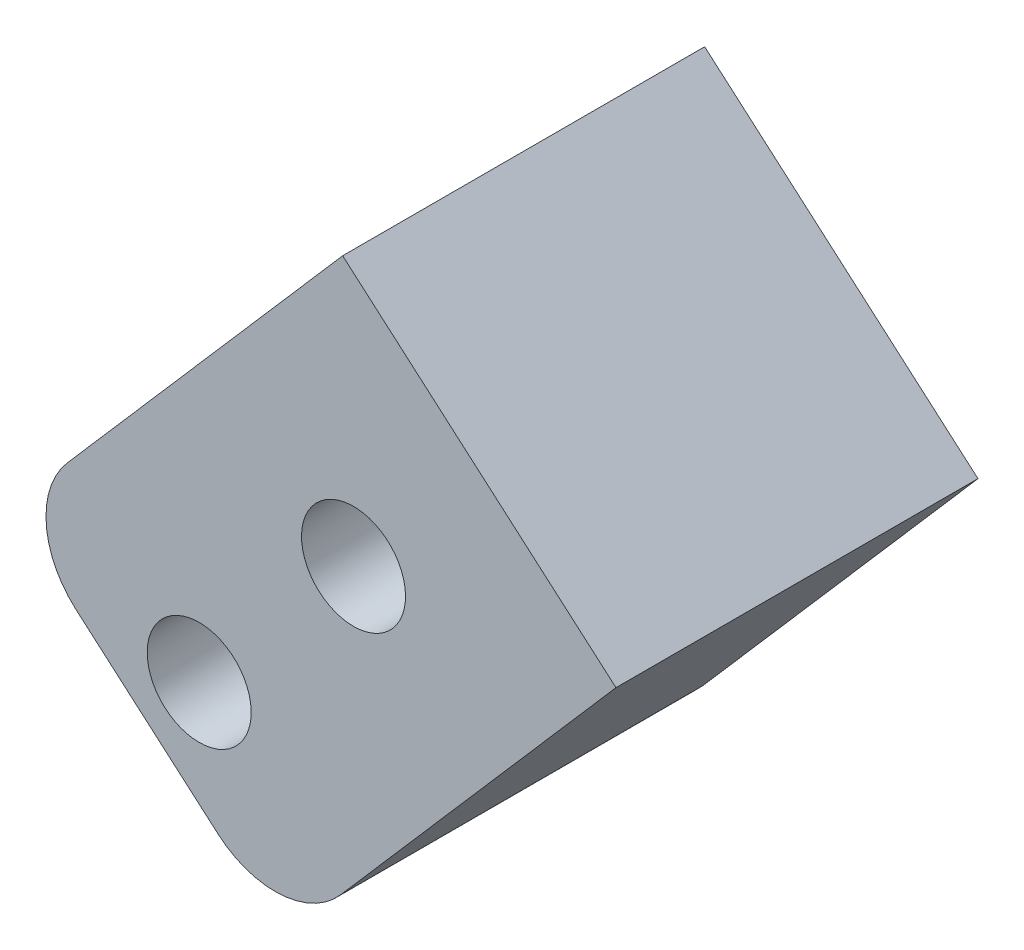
ISO-10303-21;
HEADER;
FILE_DESCRIPTION(('STEP AP214'),'2;1');
FILE_NAME('part.step','',(''),(''),'','','');
FILE_SCHEMA(('AUTOMOTIVE_DESIGN { 1 0 10303 214 1 1 1 1 }'));
ENDSEC;
DATA;
#1=APPLICATION_CONTEXT('core data for automotive mechanical design processes');
#2=APPLICATION_PROTOCOL_DEFINITION('international standard','automotive_design',2000,#1);
#3=PRODUCT_CONTEXT('',#1,'mechanical');
#4=PRODUCT('Part','Part','',(#3));
#5=PRODUCT_RELATED_PRODUCT_CATEGORY('part','',(#4));
#6=PRODUCT_DEFINITION_FORMATION('','',#4);
#7=PRODUCT_DEFINITION_CONTEXT('part definition',#1,'design');
#8=PRODUCT_DEFINITION('design','',#6,#7);
#9=PRODUCT_DEFINITION_SHAPE('','',#8);
#10=(LENGTH_UNIT() NAMED_UNIT(*) SI_UNIT(.MILLI.,.METRE.));
#11=(NAMED_UNIT(*) PLANE_ANGLE_UNIT() SI_UNIT($,.RADIAN.));
#12=(NAMED_UNIT(*) SI_UNIT($,.STERADIAN.) SOLID_ANGLE_UNIT());
#13=UNCERTAINTY_MEASURE_WITH_UNIT(LENGTH_MEASURE(1.E-05),#10,'distance_accuracy_value','');
#14=(GEOMETRIC_REPRESENTATION_CONTEXT(3) GLOBAL_UNCERTAINTY_ASSIGNED_CONTEXT((#13)) GLOBAL_UNIT_ASSIGNED_CONTEXT((#10,
#11,#12)) REPRESENTATION_CONTEXT('',''));
#15=CARTESIAN_POINT('',(0.,0.,0.));
#16=DIRECTION('',(0.,0.,1.));
#17=DIRECTION('',(1.,0.,0.));
#18=AXIS2_PLACEMENT_3D('',#15,#16,#17);
#19=CARTESIAN_POINT('',(0.,0.,-0.000643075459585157));
#20=DIRECTION('',(1.58417609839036E-11,-5.13786431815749E-12,-1.));
#21=DIRECTION('',(-1.,0.,-1.58417609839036E-11));
#22=AXIS2_PLACEMENT_3D('',#19,#20,#21);
#23=PLANE('',#22);
#24=CARTESIAN_POINT('',(-681.397191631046,-83.5701362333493,-0.000643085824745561));
#25=DIRECTION('',(0.,5.13786431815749E-12,1.));
#26=DIRECTION('',(0.,-1.,5.13786431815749E-12));
#27=AXIS2_PLACEMENT_3D('',#24,#25,#26);
#28=CIRCLE('',#27,4.55930000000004);
#29=CARTESIAN_POINT('',(-681.397191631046,-88.1294362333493,-0.000643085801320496));
#30=VERTEX_POINT('',#29);
#31=EDGE_CURVE('E199',#30,#30,#28,.T.);
#32=ORIENTED_EDGE('',*,*,#31,.F.);
#33=EDGE_LOOP('',(#32));
#34=FACE_BOUND('',#33,.T.);
#35=CARTESIAN_POINT('',(-694.928996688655,-99.1520699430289,-0.000643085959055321));
#36=DIRECTION('',(0.,5.13786431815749E-12,1.));
#37=DIRECTION('',(0.,-1.,5.13786431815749E-12));
#38=AXIS2_PLACEMENT_3D('',#35,#36,#37);
#39=CIRCLE('',#38,4.55930000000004);
#40=CARTESIAN_POINT('',(-694.928996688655,-103.711369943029,-0.000643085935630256));
#41=VERTEX_POINT('',#40);
#42=EDGE_CURVE('E183',#41,#41,#39,.T.);
#43=ORIENTED_EDGE('',*,*,#42,.F.);
#44=EDGE_LOOP('',(#43));
#45=FACE_BOUND('',#44,.T.);
#46=CARTESIAN_POINT('',(-700.745406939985,-93.259903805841,-0.000643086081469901));
#47=DIRECTION('',(1.58417609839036E-11,-5.13786431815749E-12,-1.));
#48=DIRECTION('',(-1.,0.,-1.58417609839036E-11));
#49=AXIS2_PLACEMENT_3D('',#46,#47,#48);
#50=CIRCLE('',#49,7.62000000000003);
#51=CARTESIAN_POINT('',(-705.741765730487,-99.0132331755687,-0.000643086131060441));
#52=VERTEX_POINT('',#51);
#53=CARTESIAN_POINT('',(-706.498736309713,-88.2635450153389,-0.000643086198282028));
#54=VERTEX_POINT('',#53);
#55=EDGE_CURVE('E100',#52,#54,#50,.T.);
#56=ORIENTED_EDGE('',*,*,#55,.F.);
#57=DIRECTION('',(-0.755030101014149,0.655690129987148,-1.53298533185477E-11));
#58=VECTOR('',#57,1.);
#59=CARTESIAN_POINT('',(-705.741765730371,-99.0132331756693,-0.000643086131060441));
#60=LINE('',#59,#58);
#61=CARTESIAN_POINT('',(-693.276218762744,-109.838677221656,-0.000643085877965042));
#62=VERTEX_POINT('',#61);
#63=EDGE_CURVE('E107',#62,#52,#60,.T.);
#64=ORIENTED_EDGE('',*,*,#63,.F.);
#65=CARTESIAN_POINT('',(-688.279859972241,-104.085347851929,-0.000643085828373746));
#66=DIRECTION('',(1.58417609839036E-11,-5.13786431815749E-12,-1.));
#67=DIRECTION('',(-1.,0.,-1.58417609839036E-11));
#68=AXIS2_PLACEMENT_3D('',#65,#66,#67);
#69=CIRCLE('',#68,7.61999999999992);
#70=CARTESIAN_POINT('',(-682.526530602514,-109.081706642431,-0.000643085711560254));
#71=VERTEX_POINT('',#70);
#72=EDGE_CURVE('E173',#71,#62,#69,.T.);
#73=ORIENTED_EDGE('',*,*,#72,.F.);
#74=DIRECTION('',(-0.655690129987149,-0.755030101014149,-6.50804410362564E-12));
#75=VECTOR('',#74,1.);
#76=CARTESIAN_POINT('',(-658.377463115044,-81.2739480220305,-0.00064308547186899));
#77=LINE('',#76,#75);
#78=CARTESIAN_POINT('',(-658.377463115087,-81.2739480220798,-0.000643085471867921));
#79=VERTEX_POINT('',#78);
#80=EDGE_CURVE('E169',#79,#71,#77,.T.);
#81=ORIENTED_EDGE('',*,*,#80,.F.);
#82=DIRECTION('',(0.755030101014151,-0.655690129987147,1.53298533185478E-11));
#83=VECTOR('',#82,1.);
#84=CARTESIAN_POINT('',(-682.349668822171,-60.4557863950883,-0.000643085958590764));
#85=LINE('',#84,#83);
#86=CARTESIAN_POINT('',(-682.349668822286,-60.4557863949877,-0.000643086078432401));
#87=VERTEX_POINT('',#86);
#88=EDGE_CURVE('E64',#87,#79,#85,.T.);
#89=ORIENTED_EDGE('',*,*,#88,.F.);
#90=DIRECTION('',(0.655690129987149,0.755030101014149,6.50804410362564E-12));
#91=VECTOR('',#90,1.);
#92=CARTESIAN_POINT('',(-682.349668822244,-60.4557863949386,-0.000643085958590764));
#93=LINE('',#92,#91);
#94=EDGE_CURVE('E12',#54,#87,#93,.T.);
#95=ORIENTED_EDGE('',*,*,#94,.F.);
#96=EDGE_LOOP('',(#56,#64,#73,#81,#89,#95));
#97=FACE_BOUND('',#96,.T.);
#98=ADVANCED_FACE('F48',(#34,#45,#97),#23,.F.);
#99=CARTESIAN_POINT('',(-700.745406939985,-93.259903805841,10.0076));
#100=DIRECTION('',(0.,0.,-1.));
#101=DIRECTION('',(-1.,0.,0.));
#102=AXIS2_PLACEMENT_3D('',#99,#100,#101);
#103=CYLINDRICAL_SURFACE('',#102,7.62000000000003);
#104=DIRECTION('',(0.,0.,-1.));
#105=VECTOR('',#104,1.);
#106=CARTESIAN_POINT('',(-705.741765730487,-99.0132331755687,10.0076));
#107=LINE('',#106,#105);
#108=CARTESIAN_POINT('',(-705.741765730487,-99.0132331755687,-31.75));
#109=VERTEX_POINT('',#108);
#110=EDGE_CURVE('E57',#52,#109,#107,.T.);
#111=ORIENTED_EDGE('',*,*,#110,.F.);
#112=ORIENTED_EDGE('',*,*,#55,.T.);
#113=DIRECTION('',(0.,0.,-1.));
#114=VECTOR('',#113,1.);
#115=CARTESIAN_POINT('',(-706.498736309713,-88.2635450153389,10.0076));
#116=LINE('',#115,#114);
#117=CARTESIAN_POINT('',(-706.498736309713,-88.2635450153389,-31.75));
#118=VERTEX_POINT('',#117);
#119=EDGE_CURVE('E71',#54,#118,#116,.T.);
#120=ORIENTED_EDGE('',*,*,#119,.T.);
#121=CARTESIAN_POINT('',(-700.745406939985,-93.259903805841,-31.75));
#122=DIRECTION('',(0.,0.,1.));
#123=DIRECTION('',(1.,0.,0.));
#124=AXIS2_PLACEMENT_3D('',#121,#122,#123);
#125=CIRCLE('',#124,7.62000000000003);
#126=EDGE_CURVE('E106',#118,#109,#125,.T.);
#127=ORIENTED_EDGE('',*,*,#126,.T.);
#128=EDGE_LOOP('',(#111,#112,#120,#127));
#129=FACE_BOUND('',#128,.T.);
#130=ADVANCED_FACE('F50',(#129),#103,.T.);
#131=CARTESIAN_POINT('',(-705.741765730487,-99.0132331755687,10.0076));
#132=DIRECTION('',(0.655690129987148,0.755030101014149,0.));
#133=DIRECTION('',(-0.755030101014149,0.655690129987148,0.));
#134=AXIS2_PLACEMENT_3D('',#131,#132,#133);
#135=PLANE('',#134);
#136=DIRECTION('',(0.,0.,-1.));
#137=VECTOR('',#136,1.);
#138=CARTESIAN_POINT('',(-693.276218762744,-109.838677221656,10.0076));
#139=LINE('',#138,#137);
#140=CARTESIAN_POINT('',(-693.276218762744,-109.838677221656,-31.75));
#141=VERTEX_POINT('',#140);
#142=EDGE_CURVE('E130',#62,#141,#139,.T.);
#143=ORIENTED_EDGE('',*,*,#142,.F.);
#144=ORIENTED_EDGE('',*,*,#63,.T.);
#145=ORIENTED_EDGE('',*,*,#110,.T.);
#146=DIRECTION('',(0.755030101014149,-0.655690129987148,0.));
#147=VECTOR('',#146,1.);
#148=CARTESIAN_POINT('',(-705.741765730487,-99.0132331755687,-31.75));
#149=LINE('',#148,#147);
#150=EDGE_CURVE('E139',#109,#141,#149,.T.);
#151=ORIENTED_EDGE('',*,*,#150,.T.);
#152=EDGE_LOOP('',(#143,#144,#145,#151));
#153=FACE_BOUND('',#152,.T.);
#154=ADVANCED_FACE('F138',(#153),#135,.F.);
#155=CARTESIAN_POINT('',(-688.279859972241,-104.085347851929,10.0076));
#156=DIRECTION('',(0.,0.,-1.));
#157=DIRECTION('',(-1.,0.,0.));
#158=AXIS2_PLACEMENT_3D('',#155,#156,#157);
#159=CYLINDRICAL_SURFACE('',#158,7.61999999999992);
#160=DIRECTION('',(0.,0.,-1.));
#161=VECTOR('',#160,1.);
#162=CARTESIAN_POINT('',(-682.526530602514,-109.081706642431,10.0076));
#163=LINE('',#162,#161);
#164=CARTESIAN_POINT('',(-682.526530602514,-109.081706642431,-31.75));
#165=VERTEX_POINT('',#164);
#166=EDGE_CURVE('E127',#71,#165,#163,.T.);
#167=ORIENTED_EDGE('',*,*,#166,.F.);
#168=ORIENTED_EDGE('',*,*,#72,.T.);
#169=ORIENTED_EDGE('',*,*,#142,.T.);
#170=CARTESIAN_POINT('',(-688.279859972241,-104.085347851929,-31.75));
#171=DIRECTION('',(0.,0.,1.));
#172=DIRECTION('',(-1.,0.,0.));
#173=AXIS2_PLACEMENT_3D('',#170,#171,#172);
#174=CIRCLE('',#173,7.61999999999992);
#175=EDGE_CURVE('E145',#141,#165,#174,.T.);
#176=ORIENTED_EDGE('',*,*,#175,.T.);
#177=EDGE_LOOP('',(#167,#168,#169,#176));
#178=FACE_BOUND('',#177,.T.);
#179=ADVANCED_FACE('F172',(#178),#159,.T.);
#180=CARTESIAN_POINT('',(-658.377463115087,-81.2739480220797,10.0076));
#181=DIRECTION('',(-0.755030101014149,0.655690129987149,0.));
#182=DIRECTION('',(-0.655690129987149,-0.755030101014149,0.));
#183=AXIS2_PLACEMENT_3D('',#180,#181,#182);
#184=PLANE('',#183);
#185=DIRECTION('',(0.,0.,-1.));
#186=VECTOR('',#185,1.);
#187=CARTESIAN_POINT('',(-658.377463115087,-81.2739480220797,10.0076));
#188=LINE('',#187,#186);
#189=CARTESIAN_POINT('',(-658.377463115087,-81.2739480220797,-31.75));
#190=VERTEX_POINT('',#189);
#191=EDGE_CURVE('E119',#79,#190,#188,.T.);
#192=ORIENTED_EDGE('',*,*,#191,.F.);
#193=ORIENTED_EDGE('',*,*,#80,.T.);
#194=ORIENTED_EDGE('',*,*,#166,.T.);
#195=DIRECTION('',(0.655690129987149,0.755030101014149,0.));
#196=VECTOR('',#195,1.);
#197=CARTESIAN_POINT('',(-658.377463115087,-81.2739480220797,-31.75));
#198=LINE('',#197,#196);
#199=EDGE_CURVE('E155',#165,#190,#198,.T.);
#200=ORIENTED_EDGE('',*,*,#199,.T.);
#201=EDGE_LOOP('',(#192,#193,#194,#200));
#202=FACE_BOUND('',#201,.T.);
#203=ADVANCED_FACE('F166',(#202),#184,.F.);
#204=CARTESIAN_POINT('',(-682.349668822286,-60.4557863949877,10.0076));
#205=DIRECTION('',(-0.655690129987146,-0.755030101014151,0.));
#206=DIRECTION('',(0.755030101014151,-0.655690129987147,0.));
#207=AXIS2_PLACEMENT_3D('',#204,#205,#206);
#208=PLANE('',#207);
#209=DIRECTION('',(0.,0.,-1.));
#210=VECTOR('',#209,1.);
#211=CARTESIAN_POINT('',(-682.349668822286,-60.4557863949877,10.0076));
#212=LINE('',#211,#210);
#213=CARTESIAN_POINT('',(-682.349668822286,-60.4557863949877,-31.75));
#214=VERTEX_POINT('',#213);
#215=EDGE_CURVE('E114',#87,#214,#212,.T.);
#216=ORIENTED_EDGE('',*,*,#215,.F.);
#217=ORIENTED_EDGE('',*,*,#88,.T.);
#218=ORIENTED_EDGE('',*,*,#191,.T.);
#219=DIRECTION('',(-0.755030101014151,0.655690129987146,0.));
#220=VECTOR('',#219,1.);
#221=CARTESIAN_POINT('',(-682.349668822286,-60.4557863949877,-31.75));
#222=LINE('',#221,#220);
#223=EDGE_CURVE('E121',#190,#214,#222,.T.);
#224=ORIENTED_EDGE('',*,*,#223,.T.);
#225=EDGE_LOOP('',(#216,#217,#218,#224));
#226=FACE_BOUND('',#225,.T.);
#227=ADVANCED_FACE('F163',(#226),#208,.F.);
#228=CARTESIAN_POINT('',(-682.349668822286,-60.4557863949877,10.0076));
#229=DIRECTION('',(0.755030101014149,-0.655690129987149,0.));
#230=DIRECTION('',(0.655690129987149,0.755030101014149,0.));
#231=AXIS2_PLACEMENT_3D('',#228,#229,#230);
#232=PLANE('',#231);
#233=ORIENTED_EDGE('',*,*,#119,.F.);
#234=ORIENTED_EDGE('',*,*,#94,.T.);
#235=ORIENTED_EDGE('',*,*,#215,.T.);
#236=DIRECTION('',(-0.655690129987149,-0.755030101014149,0.));
#237=VECTOR('',#236,1.);
#238=CARTESIAN_POINT('',(-682.349668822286,-60.4557863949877,-31.75));
#239=LINE('',#238,#237);
#240=EDGE_CURVE('E111',#214,#118,#239,.T.);
#241=ORIENTED_EDGE('',*,*,#240,.T.);
#242=EDGE_LOOP('',(#233,#234,#235,#241));
#243=FACE_BOUND('',#242,.T.);
#244=ADVANCED_FACE('F109',(#243),#232,.F.);
#245=CARTESIAN_POINT('',(-700.745406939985,-93.259903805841,-31.75));
#246=DIRECTION('',(0.,0.,1.));
#247=DIRECTION('',(1.,0.,0.));
#248=AXIS2_PLACEMENT_3D('',#245,#246,#247);
#249=PLANE('',#248);
#250=CARTESIAN_POINT('',(-681.397191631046,-83.5701362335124,-31.7500000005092));
#251=DIRECTION('',(0.,5.13786431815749E-12,1.));
#252=DIRECTION('',(0.,-1.,5.13786431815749E-12));
#253=AXIS2_PLACEMENT_3D('',#250,#251,#252);
#254=CIRCLE('',#253,2.80669999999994);
#255=CARTESIAN_POINT('',(-681.397191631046,-86.3768362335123,-31.7500000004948));
#256=VERTEX_POINT('',#255);
#257=EDGE_CURVE('E211',#256,#256,#254,.T.);
#258=ORIENTED_EDGE('',*,*,#257,.T.);
#259=EDGE_LOOP('',(#258));
#260=FACE_BOUND('',#259,.T.);
#261=CARTESIAN_POINT('',(-694.928996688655,-99.152069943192,-31.7500000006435));
#262=DIRECTION('',(0.,5.13786431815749E-12,1.));
#263=DIRECTION('',(0.,-1.,5.13786431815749E-12));
#264=AXIS2_PLACEMENT_3D('',#261,#262,#263);
#265=CIRCLE('',#264,2.80669999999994);
#266=CARTESIAN_POINT('',(-694.928996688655,-101.958769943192,-31.7500000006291));
#267=VERTEX_POINT('',#266);
#268=EDGE_CURVE('E195',#267,#267,#265,.T.);
#269=ORIENTED_EDGE('',*,*,#268,.T.);
#270=EDGE_LOOP('',(#269));
#271=FACE_BOUND('',#270,.T.);
#272=ORIENTED_EDGE('',*,*,#126,.F.);
#273=ORIENTED_EDGE('',*,*,#240,.F.);
#274=ORIENTED_EDGE('',*,*,#223,.F.);
#275=ORIENTED_EDGE('',*,*,#199,.F.);
#276=ORIENTED_EDGE('',*,*,#175,.F.);
#277=ORIENTED_EDGE('',*,*,#150,.F.);
#278=EDGE_LOOP('',(#272,#273,#274,#275,#276,#277));
#279=FACE_BOUND('',#278,.T.);
#280=ADVANCED_FACE('F142',(#260,#271,#279),#249,.F.);
#281=CARTESIAN_POINT('',(-694.928996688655,-99.1520699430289,-0.000643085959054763));
#282=DIRECTION('',(0.,5.13786431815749E-12,1.));
#283=DIRECTION('',(0.,-1.,5.13786431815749E-12));
#284=AXIS2_PLACEMENT_3D('',#281,#282,#283);
#285=CYLINDRICAL_SURFACE('',#284,4.55930000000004);
#286=CARTESIAN_POINT('',(-694.928996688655,-99.1520699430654,-7.11264308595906));
#287=DIRECTION('',(0.,5.13786431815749E-12,1.));
#288=DIRECTION('',(0.,-1.,5.13786431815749E-12));
#289=AXIS2_PLACEMENT_3D('',#286,#287,#288);
#290=CIRCLE('',#289,4.55930000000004);
#291=CARTESIAN_POINT('',(-694.928996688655,-103.711369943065,-7.11264308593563));
#292=VERTEX_POINT('',#291);
#293=EDGE_CURVE('E187',#292,#292,#290,.T.);
#294=ORIENTED_EDGE('',*,*,#293,.F.);
#295=EDGE_LOOP('',(#294));
#296=FACE_BOUND('',#295,.T.);
#297=ORIENTED_EDGE('',*,*,#42,.T.);
#298=EDGE_LOOP('',(#297));
#299=FACE_BOUND('',#298,.T.);
#300=ADVANCED_FACE('F243',(#296,#299),#285,.F.);
#301=CARTESIAN_POINT('',(-692.122296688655,-99.1520699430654,-7.11264308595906));
#302=DIRECTION('',(0.,-5.13786431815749E-12,-1.));
#303=DIRECTION('',(0.,1.,-5.13786431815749E-12));
#304=AXIS2_PLACEMENT_3D('',#301,#302,#303);
#305=PLANE('',#304);
#306=CARTESIAN_POINT('',(-694.928996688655,-99.1520699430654,-7.11264308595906));
#307=DIRECTION('',(0.,5.13786431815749E-12,1.));
#308=DIRECTION('',(0.,-1.,5.13786431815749E-12));
#309=AXIS2_PLACEMENT_3D('',#306,#307,#308);
#310=CIRCLE('',#309,2.80670000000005);
#311=CARTESIAN_POINT('',(-694.928996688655,-101.958769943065,-7.11264308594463));
#312=VERTEX_POINT('',#311);
#313=EDGE_CURVE('E191',#312,#312,#310,.T.);
#314=ORIENTED_EDGE('',*,*,#313,.F.);
#315=EDGE_LOOP('',(#314));
#316=FACE_BOUND('',#315,.T.);
#317=ORIENTED_EDGE('',*,*,#293,.T.);
#318=EDGE_LOOP('',(#317));
#319=FACE_BOUND('',#318,.T.);
#320=ADVANCED_FACE('F245',(#316,#319),#305,.F.);
#321=CARTESIAN_POINT('',(-694.928996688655,-99.1520699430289,-0.000643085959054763));
#322=DIRECTION('',(0.,5.13786431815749E-12,1.));
#323=DIRECTION('',(0.,-1.,5.13786431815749E-12));
#324=AXIS2_PLACEMENT_3D('',#321,#322,#323);
#325=CYLINDRICAL_SURFACE('',#324,2.8067);
#326=ORIENTED_EDGE('',*,*,#268,.F.);
#327=EDGE_LOOP('',(#326));
#328=FACE_BOUND('',#327,.T.);
#329=ORIENTED_EDGE('',*,*,#313,.T.);
#330=EDGE_LOOP('',(#329));
#331=FACE_BOUND('',#330,.T.);
#332=ADVANCED_FACE('F234',(#328,#331),#325,.F.);
#333=CARTESIAN_POINT('',(-681.397191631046,-83.5701362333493,-0.000643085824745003));
#334=DIRECTION('',(0.,5.13786431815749E-12,1.));
#335=DIRECTION('',(0.,-1.,5.13786431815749E-12));
#336=AXIS2_PLACEMENT_3D('',#333,#334,#335);
#337=CYLINDRICAL_SURFACE('',#336,4.55930000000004);
#338=CARTESIAN_POINT('',(-681.397191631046,-83.5701362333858,-7.11264308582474));
#339=DIRECTION('',(0.,5.13786431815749E-12,1.));
#340=DIRECTION('',(0.,-1.,5.13786431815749E-12));
#341=AXIS2_PLACEMENT_3D('',#338,#339,#340);
#342=CIRCLE('',#341,4.55930000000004);
#343=CARTESIAN_POINT('',(-681.397191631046,-88.1294362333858,-7.11264308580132));
#344=VERTEX_POINT('',#343);
#345=EDGE_CURVE('E203',#344,#344,#342,.T.);
#346=ORIENTED_EDGE('',*,*,#345,.F.);
#347=EDGE_LOOP('',(#346));
#348=FACE_BOUND('',#347,.T.);
#349=ORIENTED_EDGE('',*,*,#31,.T.);
#350=EDGE_LOOP('',(#349));
#351=FACE_BOUND('',#350,.T.);
#352=ADVANCED_FACE('F228',(#348,#351),#337,.F.);
#353=CARTESIAN_POINT('',(-678.590491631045,-83.5701362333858,-7.11264308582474));
#354=DIRECTION('',(0.,-5.13786431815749E-12,-1.));
#355=DIRECTION('',(0.,1.,-5.13786431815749E-12));
#356=AXIS2_PLACEMENT_3D('',#353,#354,#355);
#357=PLANE('',#356);
#358=CARTESIAN_POINT('',(-681.397191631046,-83.5701362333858,-7.11264308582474));
#359=DIRECTION('',(0.,5.13786431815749E-12,1.));
#360=DIRECTION('',(0.,-1.,5.13786431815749E-12));
#361=AXIS2_PLACEMENT_3D('',#358,#359,#360);
#362=CIRCLE('',#361,2.80670000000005);
#363=CARTESIAN_POINT('',(-681.397191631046,-86.3768362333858,-7.11264308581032));
#364=VERTEX_POINT('',#363);
#365=EDGE_CURVE('E207',#364,#364,#362,.T.);
#366=ORIENTED_EDGE('',*,*,#365,.F.);
#367=EDGE_LOOP('',(#366));
#368=FACE_BOUND('',#367,.T.);
#369=ORIENTED_EDGE('',*,*,#345,.T.);
#370=EDGE_LOOP('',(#369));
#371=FACE_BOUND('',#370,.T.);
#372=ADVANCED_FACE('F222',(#368,#371),#357,.F.);
#373=CARTESIAN_POINT('',(-681.397191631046,-83.5701362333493,-0.000643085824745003));
#374=DIRECTION('',(0.,5.13786431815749E-12,1.));
#375=DIRECTION('',(0.,-1.,5.13786431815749E-12));
#376=AXIS2_PLACEMENT_3D('',#373,#374,#375);
#377=CYLINDRICAL_SURFACE('',#376,2.8067);
#378=ORIENTED_EDGE('',*,*,#257,.F.);
#379=EDGE_LOOP('',(#378));
#380=FACE_BOUND('',#379,.T.);
#381=ORIENTED_EDGE('',*,*,#365,.T.);
#382=EDGE_LOOP('',(#381));
#383=FACE_BOUND('',#382,.T.);
#384=ADVANCED_FACE('F219',(#380,#383),#377,.F.);
#385=CLOSED_SHELL('',(#98,#130,#154,#179,#203,#227,#244,#280,#300,#320,#332,#352,#372,#384));
#386=MANIFOLD_SOLID_BREP('B2',#385);
#387=ADVANCED_BREP_SHAPE_REPRESENTATION('',(#18,#386),#14);
#388=SHAPE_DEFINITION_REPRESENTATION(#9,#387);
ENDSEC;
END-ISO-10303-21;
